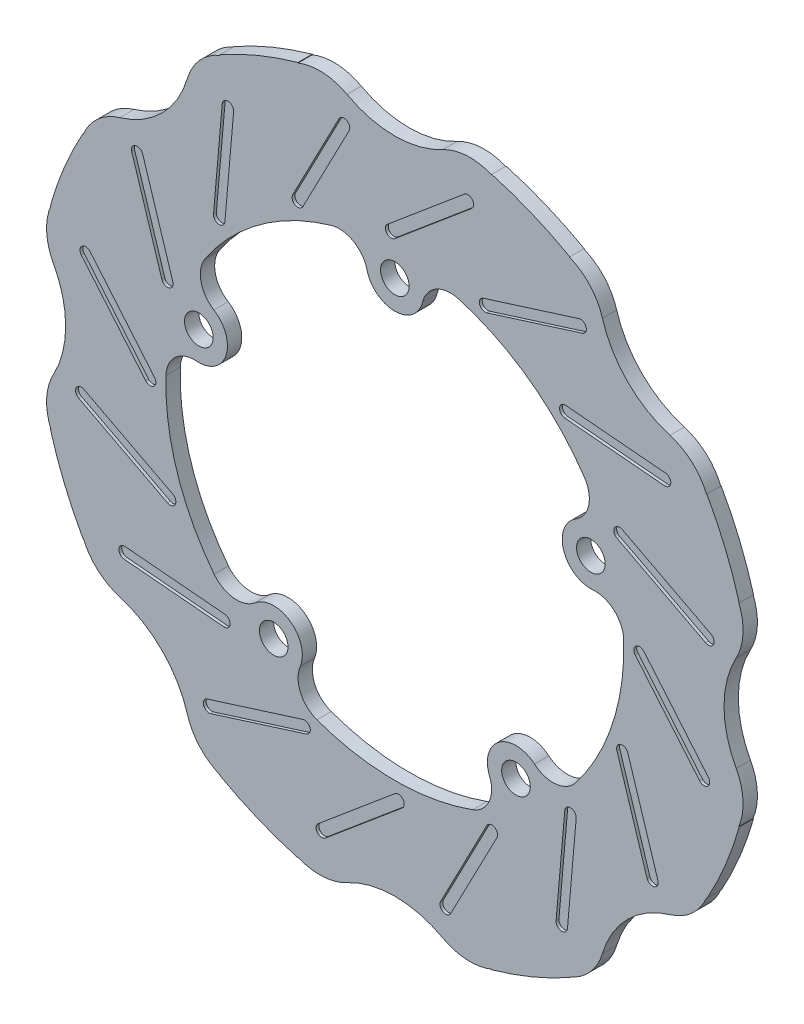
from build123d import *

# Parameters (mm, degrees)
SKETCH1_R                  = 125
SKETCH1_R_2                = 80
BOSS_EXTRUDE1_DEPTH        = 5
CUT_EXTRUDE1_DEPTH         = 177.847391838
BOSS_EXTRUDE2_DEPTH        = 5
F_10_0_10_DIAMETER_HOLE1_D = 10
CIRPATTERN6_COUNT          = 8
CUT_EXTRUDE4_DEPTH         = 1
CIRPATTERN8_COUNT          = 16
CIRPATTERN11_COUNT         = 5


with BuildPart() as part:
    # Sketch1 → Boss-Extrude1 (new body)
    with BuildSketch(Plane.XY):
        Circle(SKETCH1_R)
        Circle(SKETCH1_R_2, mode=Mode.SUBTRACT)
    extrude(amount=-BOSS_EXTRUDE1_DEPTH)

    # Sketch5 → Cut-Extrude1 (cut, through all)
    with BuildSketch(Plane.XY):
        with BuildLine():
            Line((33.855590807, 120.162738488), (33.855590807, 137))
            Line((33.855590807, 137), (-33.855590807, 137))
            Line((-33.855590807, 137), (-33.855590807, 120.162738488))
            ThreePointArc((-33.855590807, 120.162738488), (-25.175178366, 121.637942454), (-16.702440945, 119.242424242))
            ThreePointArc((-16.702440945, 119.242424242), (0, 115), (16.702440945, 119.242424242))
            ThreePointArc((16.702440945, 119.242424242), (25.175178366, 121.637942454), (33.855590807, 120.162738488))
        make_face()
    cut_extrude1 = extrude(amount=-CUT_EXTRUDE1_DEPTH, mode=Mode.SUBTRACT)

    # Sketch6 → Boss-Extrude2 (add)
    with BuildSketch(Plane.XY):
        with BuildLine():
            ThreePointArc((-9.713875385, 69.625), (0, 62), (9.713875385, 69.625))
            ThreePointArc((9.713875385, 69.625), (14.416602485, 75.903807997), (22.203143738, 76.857142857))
            ThreePointArc((22.203143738, 76.857142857), (0, 80), (-22.203143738, 76.857142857))
            ThreePointArc((-22.203143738, 76.857142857), (-14.416602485, 75.903807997), (-9.713875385, 69.625))
        make_face()
    boss_extrude2 = extrude(amount=-BOSS_EXTRUDE2_DEPTH)

    # 10.0 _10_ Diameter Hole1 (through all)
    with Locations(Plane.XY):
        with Locations((0, 72)):
            f_10_0_10_diameter_hole1 = Hole(F_10_0_10_DIAMETER_HOLE1_D / 2)

    # CirPattern6: Cut-Extrude1 ×8 about axis
    cirpattern6_axis = Axis((0, 0, 0), (0, 0, 1))
    for i in range(1, CIRPATTERN6_COUNT):
        add(cut_extrude1.rotate(cirpattern6_axis, i * 360 / CIRPATTERN6_COUNT), mode=Mode.SUBTRACT)

    # Sketch13 → Cut-Extrude4 (cut)
    with BuildSketch(Plane.XY):
        with BuildLine():
            Line((0, 83.967911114), (26.811555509, 106.465477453))
            ThreePointArc((26.811555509, 106.465477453), (27.058069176, 109.283141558), (24.24040507, 109.529655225))
            Line((24.24040507, 109.529655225), (-2.571150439, 87.032088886))
            ThreePointArc((-2.571150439, 87.032088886), (-2.817664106, 84.214424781), (0, 83.967911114))
        make_face()
    cut_extrude4 = extrude(amount=-CUT_EXTRUDE4_DEPTH, mode=Mode.SUBTRACT)

    # CirPattern8: Cut-Extrude4 ×16 about axis
    cirpattern8_axis = Axis((0, 0, 0), (0, 0, 1))
    for i in range(1, CIRPATTERN8_COUNT):
        add(cut_extrude4.rotate(cirpattern8_axis, i * 360 / CIRPATTERN8_COUNT), mode=Mode.SUBTRACT)

    # CirPattern11: Boss-Extrude2, 10.0 _10_ Diameter Hole1 ×5 about axis
    cirpattern11_axis = Axis((0, 0, 0), (0, 0, 1))
    add([boss_extrude2.rotate(cirpattern11_axis, i * 360 / CIRPATTERN11_COUNT) for i in range(1, CIRPATTERN11_COUNT)])
    add([f_10_0_10_diameter_hole1.rotate(cirpattern11_axis, i * 360 / CIRPATTERN11_COUNT) for i in range(1, CIRPATTERN11_COUNT)], mode=Mode.SUBTRACT)


solid = part.part
